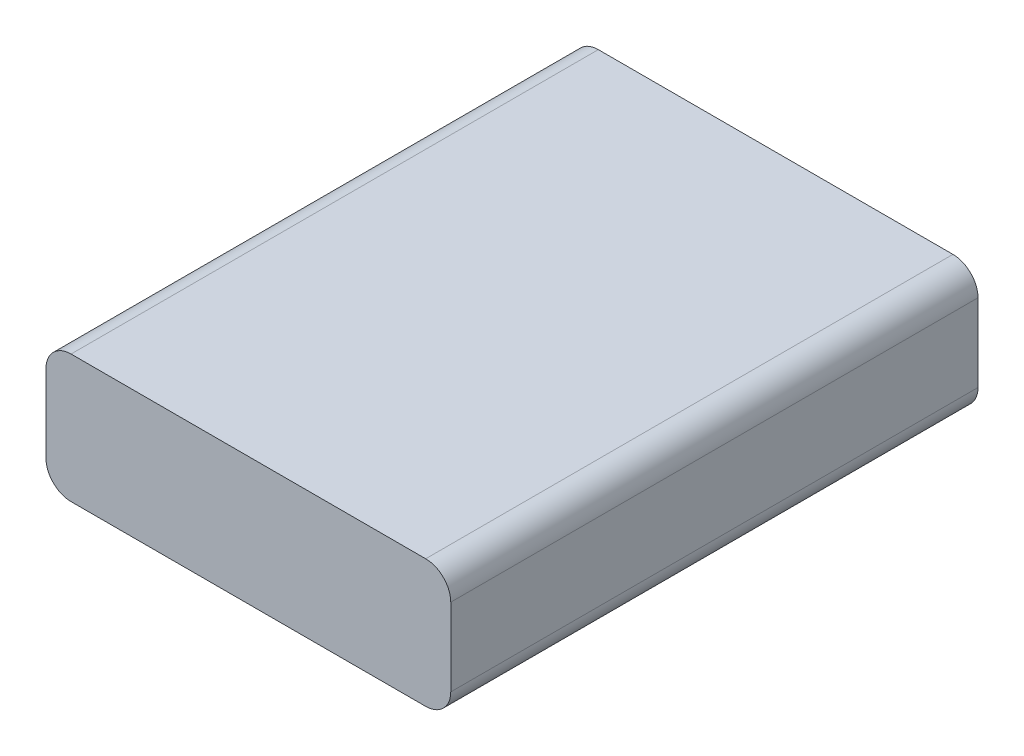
ISO-10303-21;
HEADER;
FILE_DESCRIPTION(('STEP AP214'),'2;1');
FILE_NAME('part.step','',(''),(''),'','','');
FILE_SCHEMA(('AUTOMOTIVE_DESIGN { 1 0 10303 214 1 1 1 1 }'));
ENDSEC;
DATA;
#1=APPLICATION_CONTEXT('core data for automotive mechanical design processes');
#2=APPLICATION_PROTOCOL_DEFINITION('international standard','automotive_design',2000,#1);
#3=PRODUCT_CONTEXT('',#1,'mechanical');
#4=PRODUCT('Part','Part','',(#3));
#5=PRODUCT_RELATED_PRODUCT_CATEGORY('part','',(#4));
#6=PRODUCT_DEFINITION_FORMATION('','',#4);
#7=PRODUCT_DEFINITION_CONTEXT('part definition',#1,'design');
#8=PRODUCT_DEFINITION('design','',#6,#7);
#9=PRODUCT_DEFINITION_SHAPE('','',#8);
#10=(LENGTH_UNIT() NAMED_UNIT(*) SI_UNIT(.MILLI.,.METRE.));
#11=(NAMED_UNIT(*) PLANE_ANGLE_UNIT() SI_UNIT($,.RADIAN.));
#12=(NAMED_UNIT(*) SI_UNIT($,.STERADIAN.) SOLID_ANGLE_UNIT());
#13=UNCERTAINTY_MEASURE_WITH_UNIT(LENGTH_MEASURE(1.E-05),#10,'distance_accuracy_value','');
#14=(GEOMETRIC_REPRESENTATION_CONTEXT(3) GLOBAL_UNCERTAINTY_ASSIGNED_CONTEXT((#13)) GLOBAL_UNIT_ASSIGNED_CONTEXT((#10,
#11,#12)) REPRESENTATION_CONTEXT('',''));
#15=CARTESIAN_POINT('',(0.,0.,0.));
#16=DIRECTION('',(0.,0.,1.));
#17=DIRECTION('',(1.,0.,0.));
#18=AXIS2_PLACEMENT_3D('',#15,#16,#17);
#19=CARTESIAN_POINT('',(0.,0.,0.));
#20=DIRECTION('',(0.,1.,0.));
#21=DIRECTION('',(0.,0.,1.));
#22=AXIS2_PLACEMENT_3D('',#19,#20,#21);
#23=PLANE('',#22);
#24=DIRECTION('',(1.,0.,0.));
#25=VECTOR('',#24,1.);
#26=CARTESIAN_POINT('',(-24.22,0.,31.55));
#27=LINE('',#26,#25);
#28=CARTESIAN_POINT('',(-21.22,0.,31.55));
#29=VERTEX_POINT('',#28);
#30=CARTESIAN_POINT('',(21.22,0.,31.55));
#31=VERTEX_POINT('',#30);
#32=EDGE_CURVE('E151',#29,#31,#27,.T.);
#33=ORIENTED_EDGE('',*,*,#32,.F.);
#34=DIRECTION('',(0.,0.,1.));
#35=VECTOR('',#34,1.);
#36=CARTESIAN_POINT('',(-21.22,0.,0.));
#37=LINE('',#36,#35);
#38=CARTESIAN_POINT('',(-21.22,0.,-31.55));
#39=VERTEX_POINT('',#38);
#40=EDGE_CURVE('E191',#29,#39,#37,.F.);
#41=ORIENTED_EDGE('',*,*,#40,.T.);
#42=DIRECTION('',(-1.,0.,0.));
#43=VECTOR('',#42,1.);
#44=CARTESIAN_POINT('',(-24.22,0.,-31.55));
#45=LINE('',#44,#43);
#46=CARTESIAN_POINT('',(21.22,0.,-31.55));
#47=VERTEX_POINT('',#46);
#48=EDGE_CURVE('E148',#47,#39,#45,.T.);
#49=ORIENTED_EDGE('',*,*,#48,.F.);
#50=DIRECTION('',(0.,0.,-1.));
#51=VECTOR('',#50,1.);
#52=CARTESIAN_POINT('',(21.22,0.,0.));
#53=LINE('',#52,#51);
#54=EDGE_CURVE('E189',#47,#31,#53,.F.);
#55=ORIENTED_EDGE('',*,*,#54,.T.);
#56=EDGE_LOOP('',(#33,#41,#49,#55));
#57=FACE_BOUND('',#56,.T.);
#58=DIRECTION('',(0.,0.,-1.));
#59=VECTOR('',#58,1.);
#60=CARTESIAN_POINT('',(9.22,0.,27.25));
#61=LINE('',#60,#59);
#62=CARTESIAN_POINT('',(9.22,0.,27.25));
#63=VERTEX_POINT('',#62);
#64=CARTESIAN_POINT('',(9.22,0.,24.15));
#65=VERTEX_POINT('',#64);
#66=EDGE_CURVE('E147',#63,#65,#61,.T.);
#67=ORIENTED_EDGE('',*,*,#66,.F.);
#68=DIRECTION('',(-1.,0.,0.));
#69=VECTOR('',#68,1.);
#70=CARTESIAN_POINT('',(9.22,0.,27.25));
#71=LINE('',#70,#69);
#72=CARTESIAN_POINT('',(15.22,0.,27.25));
#73=VERTEX_POINT('',#72);
#74=EDGE_CURVE('E144',#73,#63,#71,.T.);
#75=ORIENTED_EDGE('',*,*,#74,.F.);
#76=DIRECTION('',(0.,0.,1.));
#77=VECTOR('',#76,1.);
#78=CARTESIAN_POINT('',(15.22,0.,27.25));
#79=LINE('',#78,#77);
#80=CARTESIAN_POINT('',(15.22,0.,24.15));
#81=VERTEX_POINT('',#80);
#82=EDGE_CURVE('E361',#81,#73,#79,.T.);
#83=ORIENTED_EDGE('',*,*,#82,.F.);
#84=DIRECTION('',(1.,0.,0.));
#85=VECTOR('',#84,1.);
#86=CARTESIAN_POINT('',(9.22,0.,24.15));
#87=LINE('',#86,#85);
#88=EDGE_CURVE('E363',#65,#81,#87,.T.);
#89=ORIENTED_EDGE('',*,*,#88,.F.);
#90=EDGE_LOOP('',(#67,#75,#83,#89));
#91=FACE_BOUND('',#90,.T.);
#92=ADVANCED_FACE('F33',(#57,#91),#23,.F.);
#93=CARTESIAN_POINT('',(24.22,15.3,-31.55));
#94=DIRECTION('',(-1.,0.,0.));
#95=DIRECTION('',(0.,0.,1.));
#96=AXIS2_PLACEMENT_3D('',#93,#94,#95);
#97=PLANE('',#96);
#98=DIRECTION('',(0.,-1.,0.));
#99=VECTOR('',#98,1.);
#100=CARTESIAN_POINT('',(24.22,15.3,-31.55));
#101=LINE('',#100,#99);
#102=CARTESIAN_POINT('',(24.22,12.3,-31.55));
#103=VERTEX_POINT('',#102);
#104=CARTESIAN_POINT('',(24.22,3.,-31.55));
#105=VERTEX_POINT('',#104);
#106=EDGE_CURVE('E174',#103,#105,#101,.T.);
#107=ORIENTED_EDGE('',*,*,#106,.F.);
#108=DIRECTION('',(0.,0.,-1.));
#109=VECTOR('',#108,1.);
#110=CARTESIAN_POINT('',(24.22,12.3,31.55));
#111=LINE('',#110,#109);
#112=CARTESIAN_POINT('',(24.22,12.3,31.55));
#113=VERTEX_POINT('',#112);
#114=EDGE_CURVE('E11',#103,#113,#111,.F.);
#115=ORIENTED_EDGE('',*,*,#114,.T.);
#116=DIRECTION('',(0.,-1.,0.));
#117=VECTOR('',#116,1.);
#118=CARTESIAN_POINT('',(24.22,15.3,31.55));
#119=LINE('',#118,#117);
#120=CARTESIAN_POINT('',(24.22,3.,31.55));
#121=VERTEX_POINT('',#120);
#122=EDGE_CURVE('E162',#113,#121,#119,.T.);
#123=ORIENTED_EDGE('',*,*,#122,.T.);
#124=DIRECTION('',(0.,0.,-1.));
#125=VECTOR('',#124,1.);
#126=CARTESIAN_POINT('',(24.22,3.,-31.55));
#127=LINE('',#126,#125);
#128=EDGE_CURVE('E41',#121,#105,#127,.T.);
#129=ORIENTED_EDGE('',*,*,#128,.T.);
#130=EDGE_LOOP('',(#107,#115,#123,#129));
#131=FACE_BOUND('',#130,.T.);
#132=ADVANCED_FACE('F205',(#131),#97,.F.);
#133=CARTESIAN_POINT('',(-24.22,15.3,-31.55));
#134=DIRECTION('',(0.,0.,1.));
#135=DIRECTION('',(1.,0.,0.));
#136=AXIS2_PLACEMENT_3D('',#133,#134,#135);
#137=PLANE('',#136);
#138=ORIENTED_EDGE('',*,*,#48,.T.);
#139=CARTESIAN_POINT('',(-21.22,3.,-31.55));
#140=DIRECTION('',(0.,0.,1.));
#141=DIRECTION('',(1.,0.,0.));
#142=AXIS2_PLACEMENT_3D('',#139,#140,#141);
#143=CIRCLE('',#142,3.);
#144=CARTESIAN_POINT('',(-24.22,3.,-31.55));
#145=VERTEX_POINT('',#144);
#146=EDGE_CURVE('E197',#39,#145,#143,.F.);
#147=ORIENTED_EDGE('',*,*,#146,.T.);
#148=DIRECTION('',(0.,-1.,0.));
#149=VECTOR('',#148,1.);
#150=CARTESIAN_POINT('',(-24.22,15.3,-31.55));
#151=LINE('',#150,#149);
#152=CARTESIAN_POINT('',(-24.22,12.3,-31.55));
#153=VERTEX_POINT('',#152);
#154=EDGE_CURVE('E171',#153,#145,#151,.T.);
#155=ORIENTED_EDGE('',*,*,#154,.F.);
#156=CARTESIAN_POINT('',(-21.22,12.3,-31.55));
#157=DIRECTION('',(0.,0.,1.));
#158=DIRECTION('',(1.,0.,0.));
#159=AXIS2_PLACEMENT_3D('',#156,#157,#158);
#160=CIRCLE('',#159,3.);
#161=CARTESIAN_POINT('',(-21.22,15.3,-31.55));
#162=VERTEX_POINT('',#161);
#163=EDGE_CURVE('E195',#153,#162,#160,.F.);
#164=ORIENTED_EDGE('',*,*,#163,.T.);
#165=DIRECTION('',(-1.,0.,0.));
#166=VECTOR('',#165,1.);
#167=CARTESIAN_POINT('',(-24.22,15.3,-31.55));
#168=LINE('',#167,#166);
#169=CARTESIAN_POINT('',(21.22,15.3,-31.55));
#170=VERTEX_POINT('',#169);
#171=EDGE_CURVE('E157',#170,#162,#168,.T.);
#172=ORIENTED_EDGE('',*,*,#171,.F.);
#173=CARTESIAN_POINT('',(21.22,12.3,-31.55));
#174=DIRECTION('',(0.,0.,1.));
#175=DIRECTION('',(1.,0.,0.));
#176=AXIS2_PLACEMENT_3D('',#173,#174,#175);
#177=CIRCLE('',#176,3.);
#178=EDGE_CURVE('E56',#170,#103,#177,.F.);
#179=ORIENTED_EDGE('',*,*,#178,.T.);
#180=ORIENTED_EDGE('',*,*,#106,.T.);
#181=CARTESIAN_POINT('',(21.22,3.,-31.55));
#182=DIRECTION('',(0.,0.,1.));
#183=DIRECTION('',(1.,0.,0.));
#184=AXIS2_PLACEMENT_3D('',#181,#182,#183);
#185=CIRCLE('',#184,3.);
#186=EDGE_CURVE('E48',#105,#47,#185,.F.);
#187=ORIENTED_EDGE('',*,*,#186,.T.);
#188=EDGE_LOOP('',(#138,#147,#155,#164,#172,#179,#180,#187));
#189=FACE_BOUND('',#188,.T.);
#190=ADVANCED_FACE('F209',(#189),#137,.F.);
#191=CARTESIAN_POINT('',(-24.22,15.3,-31.55));
#192=DIRECTION('',(1.,0.,0.));
#193=DIRECTION('',(0.,0.,-1.));
#194=AXIS2_PLACEMENT_3D('',#191,#192,#193);
#195=PLANE('',#194);
#196=ORIENTED_EDGE('',*,*,#154,.T.);
#197=DIRECTION('',(0.,0.,1.));
#198=VECTOR('',#197,1.);
#199=CARTESIAN_POINT('',(-24.22,3.,-31.55));
#200=LINE('',#199,#198);
#201=CARTESIAN_POINT('',(-24.22,3.,31.55));
#202=VERTEX_POINT('',#201);
#203=EDGE_CURVE('E178',#145,#202,#200,.T.);
#204=ORIENTED_EDGE('',*,*,#203,.T.);
#205=DIRECTION('',(0.,-1.,0.));
#206=VECTOR('',#205,1.);
#207=CARTESIAN_POINT('',(-24.22,15.3,31.55));
#208=LINE('',#207,#206);
#209=CARTESIAN_POINT('',(-24.22,12.3,31.55));
#210=VERTEX_POINT('',#209);
#211=EDGE_CURVE('E168',#210,#202,#208,.T.);
#212=ORIENTED_EDGE('',*,*,#211,.F.);
#213=DIRECTION('',(0.,0.,1.));
#214=VECTOR('',#213,1.);
#215=CARTESIAN_POINT('',(-24.22,12.3,-31.55));
#216=LINE('',#215,#214);
#217=EDGE_CURVE('E176',#210,#153,#216,.F.);
#218=ORIENTED_EDGE('',*,*,#217,.T.);
#219=EDGE_LOOP('',(#196,#204,#212,#218));
#220=FACE_BOUND('',#219,.T.);
#221=ADVANCED_FACE('F225',(#220),#195,.F.);
#222=CARTESIAN_POINT('',(-24.22,15.3,31.55));
#223=DIRECTION('',(0.,0.,-1.));
#224=DIRECTION('',(-1.,0.,0.));
#225=AXIS2_PLACEMENT_3D('',#222,#223,#224);
#226=PLANE('',#225);
#227=ORIENTED_EDGE('',*,*,#211,.T.);
#228=CARTESIAN_POINT('',(-21.22,3.,31.55));
#229=DIRECTION('',(0.,0.,-1.));
#230=DIRECTION('',(-1.,0.,0.));
#231=AXIS2_PLACEMENT_3D('',#228,#229,#230);
#232=CIRCLE('',#231,3.);
#233=EDGE_CURVE('E187',#202,#29,#232,.F.);
#234=ORIENTED_EDGE('',*,*,#233,.T.);
#235=ORIENTED_EDGE('',*,*,#32,.T.);
#236=CARTESIAN_POINT('',(21.22,3.,31.55));
#237=DIRECTION('',(0.,0.,-1.));
#238=DIRECTION('',(-1.,0.,0.));
#239=AXIS2_PLACEMENT_3D('',#236,#237,#238);
#240=CIRCLE('',#239,3.);
#241=EDGE_CURVE('E181',#31,#121,#240,.F.);
#242=ORIENTED_EDGE('',*,*,#241,.T.);
#243=ORIENTED_EDGE('',*,*,#122,.F.);
#244=CARTESIAN_POINT('',(21.22,12.3,31.55));
#245=DIRECTION('',(0.,0.,-1.));
#246=DIRECTION('',(-1.,0.,0.));
#247=AXIS2_PLACEMENT_3D('',#244,#245,#246);
#248=CIRCLE('',#247,3.);
#249=CARTESIAN_POINT('',(21.22,15.3,31.55));
#250=VERTEX_POINT('',#249);
#251=EDGE_CURVE('E183',#113,#250,#248,.F.);
#252=ORIENTED_EDGE('',*,*,#251,.T.);
#253=DIRECTION('',(1.,0.,0.));
#254=VECTOR('',#253,1.);
#255=CARTESIAN_POINT('',(-24.22,15.3,31.55));
#256=LINE('',#255,#254);
#257=CARTESIAN_POINT('',(-21.22,15.3,31.55));
#258=VERTEX_POINT('',#257);
#259=EDGE_CURVE('E160',#258,#250,#256,.T.);
#260=ORIENTED_EDGE('',*,*,#259,.F.);
#261=CARTESIAN_POINT('',(-21.22,12.3,31.55));
#262=DIRECTION('',(0.,0.,-1.));
#263=DIRECTION('',(-1.,0.,0.));
#264=AXIS2_PLACEMENT_3D('',#261,#262,#263);
#265=CIRCLE('',#264,3.);
#266=EDGE_CURVE('E185',#258,#210,#265,.F.);
#267=ORIENTED_EDGE('',*,*,#266,.T.);
#268=EDGE_LOOP('',(#227,#234,#235,#242,#243,#252,#260,#267));
#269=FACE_BOUND('',#268,.T.);
#270=ADVANCED_FACE('F217',(#269),#226,.F.);
#271=CARTESIAN_POINT('',(0.,15.3,0.));
#272=DIRECTION('',(0.,1.,0.));
#273=DIRECTION('',(0.,0.,1.));
#274=AXIS2_PLACEMENT_3D('',#271,#272,#273);
#275=PLANE('',#274);
#276=ORIENTED_EDGE('',*,*,#171,.T.);
#277=DIRECTION('',(0.,0.,1.));
#278=VECTOR('',#277,1.);
#279=CARTESIAN_POINT('',(-21.22,15.3,31.55));
#280=LINE('',#279,#278);
#281=EDGE_CURVE('E202',#162,#258,#280,.T.);
#282=ORIENTED_EDGE('',*,*,#281,.T.);
#283=ORIENTED_EDGE('',*,*,#259,.T.);
#284=DIRECTION('',(0.,0.,-1.));
#285=VECTOR('',#284,1.);
#286=CARTESIAN_POINT('',(21.22,15.3,-31.55));
#287=LINE('',#286,#285);
#288=EDGE_CURVE('E199',#250,#170,#287,.T.);
#289=ORIENTED_EDGE('',*,*,#288,.T.);
#290=EDGE_LOOP('',(#276,#282,#283,#289));
#291=FACE_BOUND('',#290,.T.);
#292=ADVANCED_FACE('F232',(#291),#275,.T.);
#293=CARTESIAN_POINT('',(9.22,-1.9,27.25));
#294=DIRECTION('',(1.,0.,0.));
#295=DIRECTION('',(0.,0.,-1.));
#296=AXIS2_PLACEMENT_3D('',#293,#294,#295);
#297=PLANE('',#296);
#298=ORIENTED_EDGE('',*,*,#66,.T.);
#299=DIRECTION('',(0.,1.,0.));
#300=VECTOR('',#299,1.);
#301=CARTESIAN_POINT('',(9.22,-1.9,24.15));
#302=LINE('',#301,#300);
#303=CARTESIAN_POINT('',(9.22,-1.9,24.15));
#304=VERTEX_POINT('',#303);
#305=EDGE_CURVE('E128',#304,#65,#302,.T.);
#306=ORIENTED_EDGE('',*,*,#305,.F.);
#307=DIRECTION('',(0.,0.,-1.));
#308=VECTOR('',#307,1.);
#309=CARTESIAN_POINT('',(9.22,-1.9,27.25));
#310=LINE('',#309,#308);
#311=CARTESIAN_POINT('',(9.22,-1.9,27.25));
#312=VERTEX_POINT('',#311);
#313=EDGE_CURVE('E135',#312,#304,#310,.T.);
#314=ORIENTED_EDGE('',*,*,#313,.F.);
#315=DIRECTION('',(0.,1.,0.));
#316=VECTOR('',#315,1.);
#317=CARTESIAN_POINT('',(9.22,-1.9,27.25));
#318=LINE('',#317,#316);
#319=EDGE_CURVE('E366',#312,#63,#318,.T.);
#320=ORIENTED_EDGE('',*,*,#319,.T.);
#321=EDGE_LOOP('',(#298,#306,#314,#320));
#322=FACE_BOUND('',#321,.T.);
#323=ADVANCED_FACE('F146',(#322),#297,.F.);
#324=CARTESIAN_POINT('',(9.22,-1.9,24.15));
#325=DIRECTION('',(0.,0.,1.));
#326=DIRECTION('',(1.,0.,0.));
#327=AXIS2_PLACEMENT_3D('',#324,#325,#326);
#328=PLANE('',#327);
#329=ORIENTED_EDGE('',*,*,#88,.T.);
#330=DIRECTION('',(0.,1.,0.));
#331=VECTOR('',#330,1.);
#332=CARTESIAN_POINT('',(15.22,-1.9,24.15));
#333=LINE('',#332,#331);
#334=CARTESIAN_POINT('',(15.22,-1.9,24.15));
#335=VERTEX_POINT('',#334);
#336=EDGE_CURVE('E131',#335,#81,#333,.T.);
#337=ORIENTED_EDGE('',*,*,#336,.F.);
#338=DIRECTION('',(1.,0.,0.));
#339=VECTOR('',#338,1.);
#340=CARTESIAN_POINT('',(9.22,-1.9,24.15));
#341=LINE('',#340,#339);
#342=EDGE_CURVE('E123',#304,#335,#341,.T.);
#343=ORIENTED_EDGE('',*,*,#342,.F.);
#344=ORIENTED_EDGE('',*,*,#305,.T.);
#345=EDGE_LOOP('',(#329,#337,#343,#344));
#346=FACE_BOUND('',#345,.T.);
#347=ADVANCED_FACE('F126',(#346),#328,.F.);
#348=CARTESIAN_POINT('',(15.22,-1.9,27.25));
#349=DIRECTION('',(-1.,0.,0.));
#350=DIRECTION('',(0.,0.,1.));
#351=AXIS2_PLACEMENT_3D('',#348,#349,#350);
#352=PLANE('',#351);
#353=ORIENTED_EDGE('',*,*,#82,.T.);
#354=DIRECTION('',(0.,1.,0.));
#355=VECTOR('',#354,1.);
#356=CARTESIAN_POINT('',(15.22,-1.9,27.25));
#357=LINE('',#356,#355);
#358=CARTESIAN_POINT('',(15.22,-1.9,27.25));
#359=VERTEX_POINT('',#358);
#360=EDGE_CURVE('E153',#359,#73,#357,.T.);
#361=ORIENTED_EDGE('',*,*,#360,.F.);
#362=DIRECTION('',(0.,0.,1.));
#363=VECTOR('',#362,1.);
#364=CARTESIAN_POINT('',(15.22,-1.9,27.25));
#365=LINE('',#364,#363);
#366=EDGE_CURVE('E134',#335,#359,#365,.T.);
#367=ORIENTED_EDGE('',*,*,#366,.F.);
#368=ORIENTED_EDGE('',*,*,#336,.T.);
#369=EDGE_LOOP('',(#353,#361,#367,#368));
#370=FACE_BOUND('',#369,.T.);
#371=ADVANCED_FACE('F267',(#370),#352,.F.);
#372=CARTESIAN_POINT('',(9.22,-1.9,27.25));
#373=DIRECTION('',(0.,0.,-1.));
#374=DIRECTION('',(-1.,0.,0.));
#375=AXIS2_PLACEMENT_3D('',#372,#373,#374);
#376=PLANE('',#375);
#377=ORIENTED_EDGE('',*,*,#74,.T.);
#378=ORIENTED_EDGE('',*,*,#319,.F.);
#379=DIRECTION('',(-1.,0.,0.));
#380=VECTOR('',#379,1.);
#381=CARTESIAN_POINT('',(9.22,-1.9,27.25));
#382=LINE('',#381,#380);
#383=EDGE_CURVE('E140',#359,#312,#382,.T.);
#384=ORIENTED_EDGE('',*,*,#383,.F.);
#385=ORIENTED_EDGE('',*,*,#360,.T.);
#386=EDGE_LOOP('',(#377,#378,#384,#385));
#387=FACE_BOUND('',#386,.T.);
#388=ADVANCED_FACE('F262',(#387),#376,.F.);
#389=CARTESIAN_POINT('',(0.,-1.9,0.));
#390=DIRECTION('',(0.,-1.,0.));
#391=DIRECTION('',(0.,0.,-1.));
#392=AXIS2_PLACEMENT_3D('',#389,#390,#391);
#393=PLANE('',#392);
#394=ORIENTED_EDGE('',*,*,#313,.T.);
#395=ORIENTED_EDGE('',*,*,#342,.T.);
#396=ORIENTED_EDGE('',*,*,#366,.T.);
#397=ORIENTED_EDGE('',*,*,#383,.T.);
#398=EDGE_LOOP('',(#394,#395,#396,#397));
#399=FACE_BOUND('',#398,.T.);
#400=ADVANCED_FACE('F138',(#399),#393,.T.);
#401=CARTESIAN_POINT('',(-21.22,3.,-31.55));
#402=DIRECTION('',(0.,0.,1.));
#403=DIRECTION('',(1.,0.,0.));
#404=AXIS2_PLACEMENT_3D('',#401,#402,#403);
#405=CYLINDRICAL_SURFACE('',#404,3.);
#406=ORIENTED_EDGE('',*,*,#146,.F.);
#407=ORIENTED_EDGE('',*,*,#40,.F.);
#408=ORIENTED_EDGE('',*,*,#233,.F.);
#409=ORIENTED_EDGE('',*,*,#203,.F.);
#410=EDGE_LOOP('',(#406,#407,#408,#409));
#411=FACE_BOUND('',#410,.T.);
#412=ADVANCED_FACE('F220',(#411),#405,.T.);
#413=CARTESIAN_POINT('',(-21.22,12.3,0.));
#414=DIRECTION('',(0.,0.,-1.));
#415=DIRECTION('',(-1.,0.,0.));
#416=AXIS2_PLACEMENT_3D('',#413,#414,#415);
#417=CYLINDRICAL_SURFACE('',#416,3.);
#418=ORIENTED_EDGE('',*,*,#163,.F.);
#419=ORIENTED_EDGE('',*,*,#217,.F.);
#420=ORIENTED_EDGE('',*,*,#266,.F.);
#421=ORIENTED_EDGE('',*,*,#281,.F.);
#422=EDGE_LOOP('',(#418,#419,#420,#421));
#423=FACE_BOUND('',#422,.T.);
#424=ADVANCED_FACE('F229',(#423),#417,.T.);
#425=CARTESIAN_POINT('',(21.22,12.3,0.));
#426=DIRECTION('',(0.,0.,1.));
#427=DIRECTION('',(1.,0.,0.));
#428=AXIS2_PLACEMENT_3D('',#425,#426,#427);
#429=CYLINDRICAL_SURFACE('',#428,3.);
#430=ORIENTED_EDGE('',*,*,#251,.F.);
#431=ORIENTED_EDGE('',*,*,#114,.F.);
#432=ORIENTED_EDGE('',*,*,#178,.F.);
#433=ORIENTED_EDGE('',*,*,#288,.F.);
#434=EDGE_LOOP('',(#430,#431,#432,#433));
#435=FACE_BOUND('',#434,.T.);
#436=ADVANCED_FACE('F236',(#435),#429,.T.);
#437=CARTESIAN_POINT('',(21.22,3.,-31.55));
#438=DIRECTION('',(0.,0.,-1.));
#439=DIRECTION('',(-1.,0.,0.));
#440=AXIS2_PLACEMENT_3D('',#437,#438,#439);
#441=CYLINDRICAL_SURFACE('',#440,3.);
#442=ORIENTED_EDGE('',*,*,#241,.F.);
#443=ORIENTED_EDGE('',*,*,#54,.F.);
#444=ORIENTED_EDGE('',*,*,#186,.F.);
#445=ORIENTED_EDGE('',*,*,#128,.F.);
#446=EDGE_LOOP('',(#442,#443,#444,#445));
#447=FACE_BOUND('',#446,.T.);
#448=ADVANCED_FACE('F35',(#447),#441,.T.);
#449=CLOSED_SHELL('',(#92,#132,#190,#221,#270,#292,#323,#347,#371,#388,#400,#412,#424,#436,#448));
#450=MANIFOLD_SOLID_BREP('B2',#449);
#451=ADVANCED_BREP_SHAPE_REPRESENTATION('',(#18,#450),#14);
#452=SHAPE_DEFINITION_REPRESENTATION(#9,#451);
ENDSEC;
END-ISO-10303-21;
